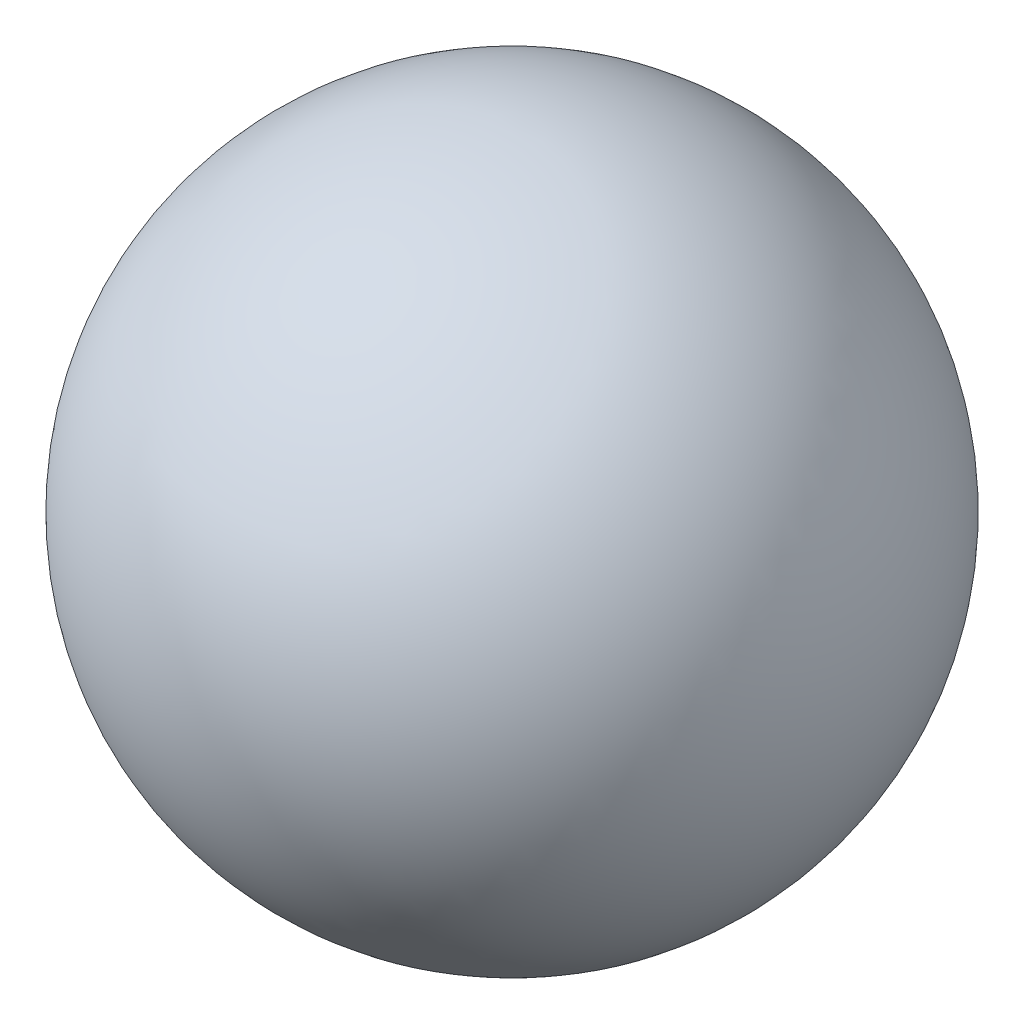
ISO-10303-21;
HEADER;
FILE_DESCRIPTION(('STEP AP214'),'2;1');
FILE_NAME('part.step','',(''),(''),'','','');
FILE_SCHEMA(('AUTOMOTIVE_DESIGN { 1 0 10303 214 1 1 1 1 }'));
ENDSEC;
DATA;
#1=APPLICATION_CONTEXT('core data for automotive mechanical design processes');
#2=APPLICATION_PROTOCOL_DEFINITION('international standard','automotive_design',2000,#1);
#3=PRODUCT_CONTEXT('',#1,'mechanical');
#4=PRODUCT('Part','Part','',(#3));
#5=PRODUCT_RELATED_PRODUCT_CATEGORY('part','',(#4));
#6=PRODUCT_DEFINITION_FORMATION('','',#4);
#7=PRODUCT_DEFINITION_CONTEXT('part definition',#1,'design');
#8=PRODUCT_DEFINITION('design','',#6,#7);
#9=PRODUCT_DEFINITION_SHAPE('','',#8);
#10=(LENGTH_UNIT() NAMED_UNIT(*) SI_UNIT(.MILLI.,.METRE.));
#11=(NAMED_UNIT(*) PLANE_ANGLE_UNIT() SI_UNIT($,.RADIAN.));
#12=(NAMED_UNIT(*) SI_UNIT($,.STERADIAN.) SOLID_ANGLE_UNIT());
#13=UNCERTAINTY_MEASURE_WITH_UNIT(LENGTH_MEASURE(1.E-05),#10,'distance_accuracy_value','');
#14=(GEOMETRIC_REPRESENTATION_CONTEXT(3) GLOBAL_UNCERTAINTY_ASSIGNED_CONTEXT((#13)) GLOBAL_UNIT_ASSIGNED_CONTEXT((#10,
#11,#12)) REPRESENTATION_CONTEXT('',''));
#15=CARTESIAN_POINT('',(0.,0.,0.));
#16=DIRECTION('',(0.,0.,1.));
#17=DIRECTION('',(1.,0.,0.));
#18=AXIS2_PLACEMENT_3D('',#15,#16,#17);
#19=CARTESIAN_POINT('',(0.,0.,0.));
#20=DIRECTION('',(0.,1.,0.));
#21=DIRECTION('',(1.,0.,0.));
#22=AXIS2_PLACEMENT_3D('',#19,#20,#21);
#23=SPHERICAL_SURFACE('',#22,32.639);
#24=CARTESIAN_POINT('',(0.,32.639,0.));
#25=VERTEX_POINT('',#24);
#26=VERTEX_LOOP('',#25);
#27=FACE_BOUND('',#26,.T.);
#28=ADVANCED_FACE('F30',(#27),#23,.T.);
#29=CLOSED_SHELL('',(#28));
#30=MANIFOLD_SOLID_BREP('B2',#29);
#31=ADVANCED_BREP_SHAPE_REPRESENTATION('',(#18,#30),#14);
#32=SHAPE_DEFINITION_REPRESENTATION(#9,#31);
ENDSEC;
END-ISO-10303-21;
